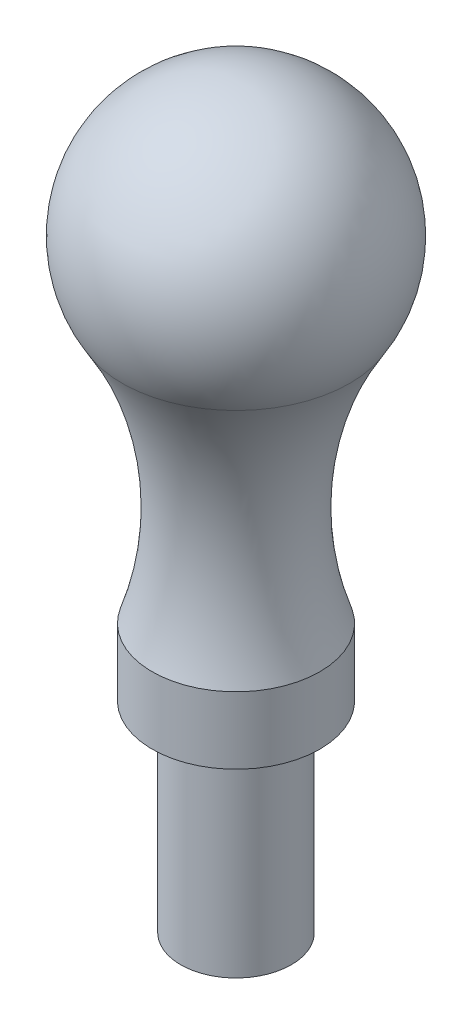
ISO-10303-21;
HEADER;
FILE_DESCRIPTION(('STEP AP214'),'2;1');
FILE_NAME('part.step','',(''),(''),'','','');
FILE_SCHEMA(('AUTOMOTIVE_DESIGN { 1 0 10303 214 1 1 1 1 }'));
ENDSEC;
DATA;
#1=APPLICATION_CONTEXT('core data for automotive mechanical design processes');
#2=APPLICATION_PROTOCOL_DEFINITION('international standard','automotive_design',2000,#1);
#3=PRODUCT_CONTEXT('',#1,'mechanical');
#4=PRODUCT('Part','Part','',(#3));
#5=PRODUCT_RELATED_PRODUCT_CATEGORY('part','',(#4));
#6=PRODUCT_DEFINITION_FORMATION('','',#4);
#7=PRODUCT_DEFINITION_CONTEXT('part definition',#1,'design');
#8=PRODUCT_DEFINITION('design','',#6,#7);
#9=PRODUCT_DEFINITION_SHAPE('','',#8);
#10=(LENGTH_UNIT() NAMED_UNIT(*) SI_UNIT(.MILLI.,.METRE.));
#11=(NAMED_UNIT(*) PLANE_ANGLE_UNIT() SI_UNIT($,.RADIAN.));
#12=(NAMED_UNIT(*) SI_UNIT($,.STERADIAN.) SOLID_ANGLE_UNIT());
#13=UNCERTAINTY_MEASURE_WITH_UNIT(LENGTH_MEASURE(1.E-05),#10,'distance_accuracy_value','');
#14=(GEOMETRIC_REPRESENTATION_CONTEXT(3) GLOBAL_UNCERTAINTY_ASSIGNED_CONTEXT((#13)) GLOBAL_UNIT_ASSIGNED_CONTEXT((#10,
#11,#12)) REPRESENTATION_CONTEXT('',''));
#15=CARTESIAN_POINT('',(0.,0.,0.));
#16=DIRECTION('',(0.,0.,1.));
#17=DIRECTION('',(1.,0.,0.));
#18=AXIS2_PLACEMENT_3D('',#15,#16,#17);
#19=CARTESIAN_POINT('',(-6.99999999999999,67.0085799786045,0.));
#20=DIRECTION('',(0.,-1.,0.));
#21=DIRECTION('',(1.,0.,0.));
#22=AXIS2_PLACEMENT_3D('',#19,#20,#21);
#23=SPHERICAL_SURFACE('',#22,4.);
#24=CARTESIAN_POINT('',(-6.99999999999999,64.8967606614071,0.));
#25=DIRECTION('',(0.,-1.,0.));
#26=DIRECTION('',(1.,0.,0.));
#27=AXIS2_PLACEMENT_3D('',#24,#25,#26);
#28=CIRCLE('',#27,3.39708980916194);
#29=CARTESIAN_POINT('',(-3.60291019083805,64.8967606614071,0.));
#30=VERTEX_POINT('',#29);
#31=EDGE_CURVE('E10',#30,#30,#28,.T.);
#32=ORIENTED_EDGE('',*,*,#31,.F.);
#33=EDGE_LOOP('',(#32));
#34=FACE_BOUND('',#33,.T.);
#35=ADVANCED_FACE('F29',(#34),#23,.T.);
#36=CARTESIAN_POINT('',(-6.99999999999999,60.0031607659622,0.));
#37=DIRECTION('',(0.,-1.,0.));
#38=DIRECTION('',(1.,0.,0.));
#39=AXIS2_PLACEMENT_3D('',#36,#37,#38);
#40=TOROIDAL_SURFACE('',#39,11.2689745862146,9.26897458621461);
#41=CARTESIAN_POINT('',(-6.99999999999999,57.,0.));
#42=DIRECTION('',(0.,-1.,0.));
#43=DIRECTION('',(1.,0.,0.));
#44=AXIS2_PLACEMENT_3D('',#41,#42,#43);
#45=CIRCLE('',#44,2.5);
#46=CARTESIAN_POINT('',(-4.49999999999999,57.,0.));
#47=VERTEX_POINT('',#46);
#48=EDGE_CURVE('E35',#47,#47,#45,.T.);
#49=ORIENTED_EDGE('',*,*,#48,.F.);
#50=EDGE_LOOP('',(#49));
#51=FACE_BOUND('',#50,.T.);
#52=ORIENTED_EDGE('',*,*,#31,.T.);
#53=EDGE_LOOP('',(#52));
#54=FACE_BOUND('',#53,.T.);
#55=ADVANCED_FACE('F68',(#51,#54),#40,.F.);
#56=CARTESIAN_POINT('',(-6.99999999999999,49.0085799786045,0.));
#57=DIRECTION('',(0.,-1.,0.));
#58=DIRECTION('',(1.,0.,0.));
#59=AXIS2_PLACEMENT_3D('',#56,#57,#58);
#60=CYLINDRICAL_SURFACE('',#59,2.5);
#61=CARTESIAN_POINT('',(-6.99999999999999,55.,0.));
#62=DIRECTION('',(0.,-1.,0.));
#63=DIRECTION('',(1.,0.,0.));
#64=AXIS2_PLACEMENT_3D('',#61,#62,#63);
#65=CIRCLE('',#64,2.5);
#66=CARTESIAN_POINT('',(-4.49999999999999,55.,0.));
#67=VERTEX_POINT('',#66);
#68=EDGE_CURVE('E39',#67,#67,#65,.T.);
#69=ORIENTED_EDGE('',*,*,#68,.F.);
#70=EDGE_LOOP('',(#69));
#71=FACE_BOUND('',#70,.T.);
#72=ORIENTED_EDGE('',*,*,#48,.T.);
#73=EDGE_LOOP('',(#72));
#74=FACE_BOUND('',#73,.T.);
#75=ADVANCED_FACE('F63',(#71,#74),#60,.T.);
#76=CARTESIAN_POINT('',(-8.64999999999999,55.,0.));
#77=DIRECTION('',(0.,1.,0.));
#78=DIRECTION('',(-1.,0.,0.));
#79=AXIS2_PLACEMENT_3D('',#76,#77,#78);
#80=PLANE('',#79);
#81=CARTESIAN_POINT('',(-6.99999999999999,55.,0.));
#82=DIRECTION('',(0.,-1.,0.));
#83=DIRECTION('',(1.,0.,0.));
#84=AXIS2_PLACEMENT_3D('',#81,#82,#83);
#85=CIRCLE('',#84,1.65);
#86=CARTESIAN_POINT('',(-5.35,55.,0.));
#87=VERTEX_POINT('',#86);
#88=EDGE_CURVE('E43',#87,#87,#85,.T.);
#89=ORIENTED_EDGE('',*,*,#88,.F.);
#90=EDGE_LOOP('',(#89));
#91=FACE_BOUND('',#90,.T.);
#92=ORIENTED_EDGE('',*,*,#68,.T.);
#93=EDGE_LOOP('',(#92));
#94=FACE_BOUND('',#93,.T.);
#95=ADVANCED_FACE('F57',(#91,#94),#80,.F.);
#96=CARTESIAN_POINT('',(-6.99999999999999,49.0085799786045,0.));
#97=DIRECTION('',(0.,-1.,0.));
#98=DIRECTION('',(1.,0.,0.));
#99=AXIS2_PLACEMENT_3D('',#96,#97,#98);
#100=CYLINDRICAL_SURFACE('',#99,1.65);
#101=CARTESIAN_POINT('',(-6.99999999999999,49.0085799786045,0.));
#102=DIRECTION('',(0.,-1.,0.));
#103=DIRECTION('',(1.,0.,0.));
#104=AXIS2_PLACEMENT_3D('',#101,#102,#103);
#105=CIRCLE('',#104,1.65);
#106=CARTESIAN_POINT('',(-5.35,49.0085799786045,0.));
#107=VERTEX_POINT('',#106);
#108=EDGE_CURVE('E48',#107,#107,#105,.T.);
#109=ORIENTED_EDGE('',*,*,#108,.F.);
#110=EDGE_LOOP('',(#109));
#111=FACE_BOUND('',#110,.T.);
#112=ORIENTED_EDGE('',*,*,#88,.T.);
#113=EDGE_LOOP('',(#112));
#114=FACE_BOUND('',#113,.T.);
#115=ADVANCED_FACE('F54',(#111,#114),#100,.T.);
#116=CARTESIAN_POINT('',(-6.99999999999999,49.0085799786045,0.));
#117=DIRECTION('',(0.,1.,0.));
#118=DIRECTION('',(-1.,0.,0.));
#119=AXIS2_PLACEMENT_3D('',#116,#117,#118);
#120=PLANE('',#119);
#121=ORIENTED_EDGE('',*,*,#108,.T.);
#122=EDGE_LOOP('',(#121));
#123=FACE_BOUND('',#122,.T.);
#124=ADVANCED_FACE('F52',(#123),#120,.F.);
#125=CLOSED_SHELL('',(#35,#55,#75,#95,#115,#124));
#126=MANIFOLD_SOLID_BREP('B2',#125);
#127=ADVANCED_BREP_SHAPE_REPRESENTATION('',(#18,#126),#14);
#128=SHAPE_DEFINITION_REPRESENTATION(#9,#127);
ENDSEC;
END-ISO-10303-21;
